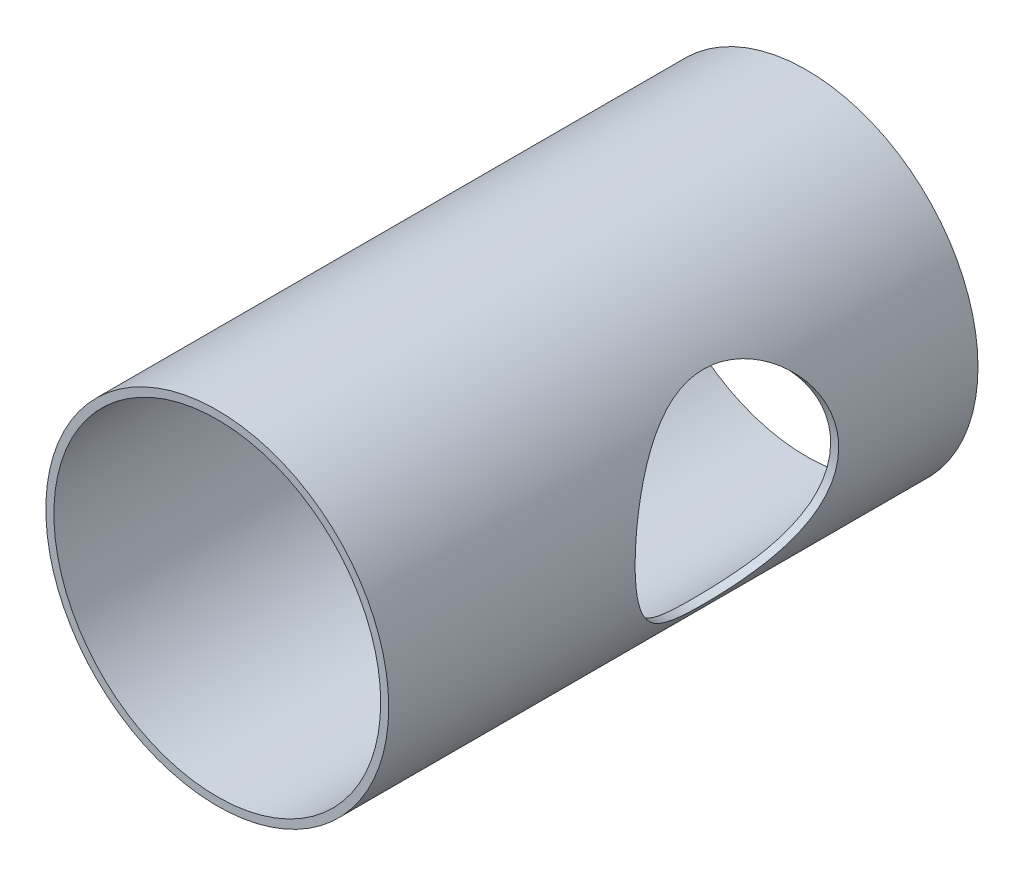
from build123d import *

# Parameters (mm, degrees)
ESQUISSE1_R           = 64
ESQUISSE1_R_2         = 61
EXTRUSION1_DEPTH      = 220
EXTRUSION2_DEPTH      = 238.890731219
EXTRUSION2_DEPTH_BACK = 238.890731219
ESQUISSE2_R           = 38


with BuildPart() as part:
    # Esquisse1 → Extrusion1 (new body)
    with BuildSketch(Plane.XY):
        Circle(ESQUISSE1_R)
        Circle(ESQUISSE1_R_2, mode=Mode.SUBTRACT)
    extrude(amount=EXTRUSION1_DEPTH)

    # Esquisse2 → Extrusion2 (cut, two sides: drawn at the far end of the back side and taken through both)
    with BuildSketch(Plane(origin=(0, 0, 0), x_dir=(0, 0, -1), z_dir=(1, 0, 0)).offset(-EXTRUSION2_DEPTH_BACK)):
        with Locations((-90, 0)):
            Circle(ESQUISSE2_R)
    extrude(amount=EXTRUSION2_DEPTH + EXTRUSION2_DEPTH_BACK, mode=Mode.SUBTRACT)


solid = part.part
